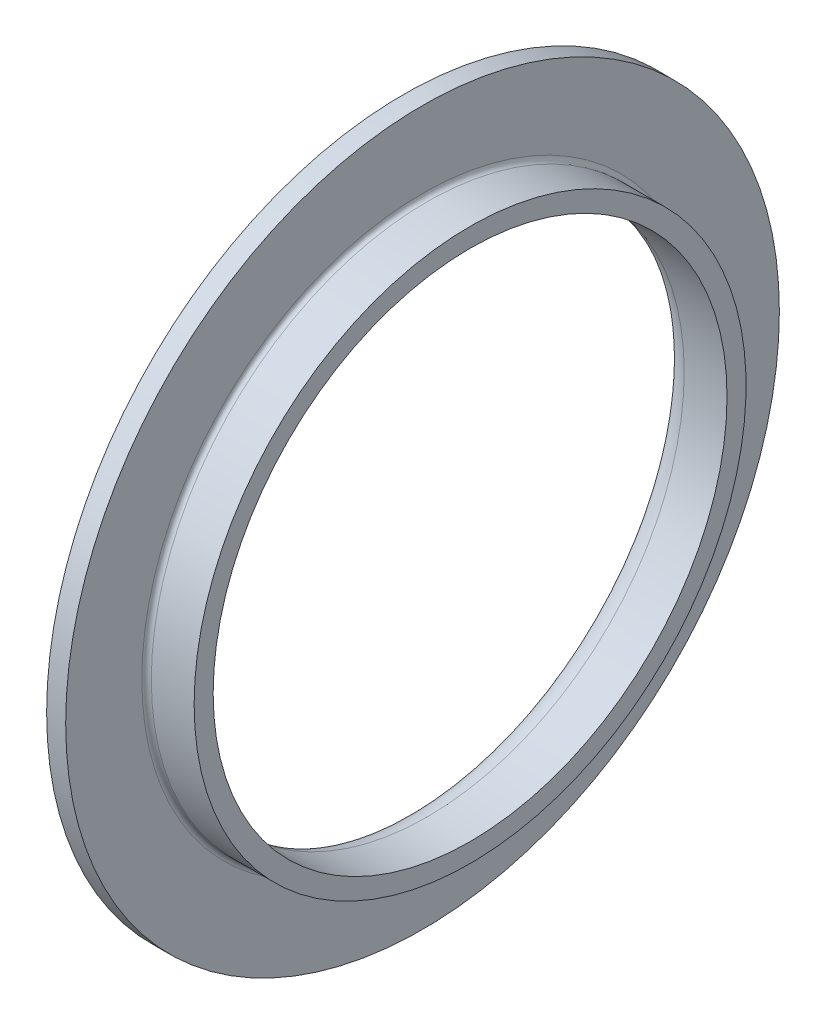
from build123d import *


with BuildPart() as part:
    # Esquisse1 → Base-R_vol.-Mince (revolve)
    with BuildSketch(Plane.XY, mode=Mode.PRIVATE) as base_r_vol_mince_sk:
        with BuildLine():
            Line((0, 37.5), (0, 29.5))
            ThreePointArc((0, 29.5), (0.732233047, 27.732233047), (2.5, 27))
            Line((2.5, 27), (7, 27))
            Line((7, 27), (7, 29))
            Line((7, 29), (2.5, 29))
            ThreePointArc((2.5, 29), (2.146446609, 29.146446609), (2, 29.5))
            Line((2, 29.5), (2, 37.5))
            Line((2, 37.5), (0, 37.5))
        make_face()
    revolve(base_r_vol_mince_sk.sketch.rotate(Axis((0, 0, 0), (1, 0, 0)), 90), axis=Axis((0, 0, 0), (1, 0, 0)))


solid = part.part
